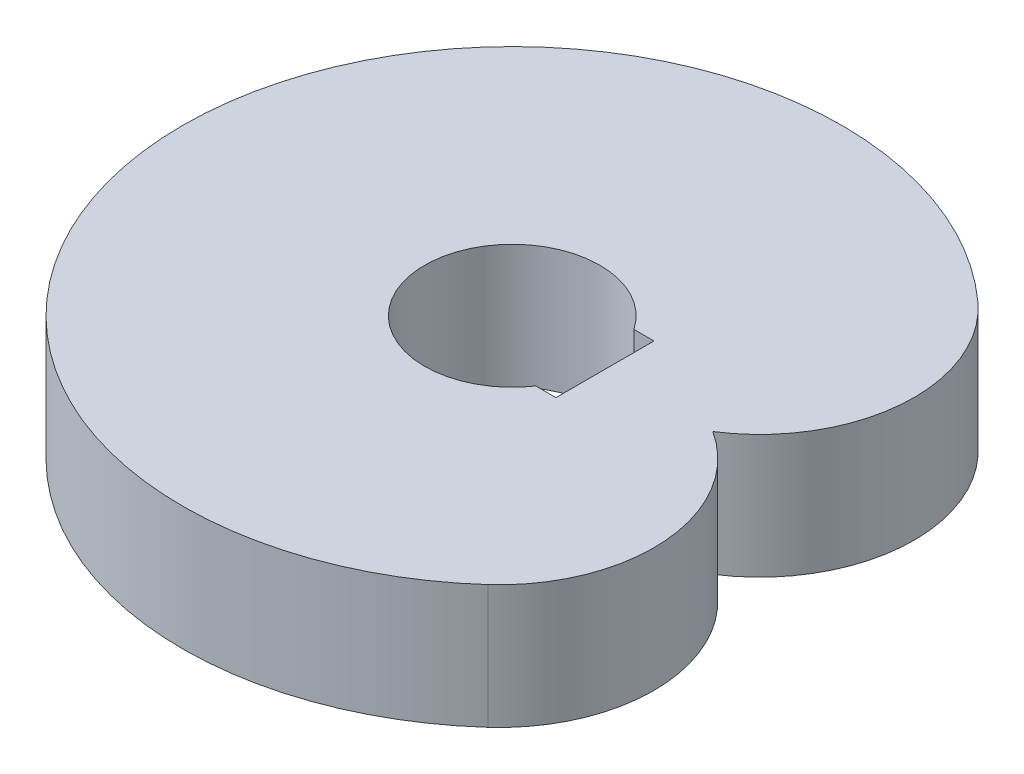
ISO-10303-21;
HEADER;
FILE_DESCRIPTION(('STEP AP214'),'2;1');
FILE_NAME('part.step','',(''),(''),'','','');
FILE_SCHEMA(('AUTOMOTIVE_DESIGN { 1 0 10303 214 1 1 1 1 }'));
ENDSEC;
DATA;
#1=APPLICATION_CONTEXT('core data for automotive mechanical design processes');
#2=APPLICATION_PROTOCOL_DEFINITION('international standard','automotive_design',2000,#1);
#3=PRODUCT_CONTEXT('',#1,'mechanical');
#4=PRODUCT('Part','Part','',(#3));
#5=PRODUCT_RELATED_PRODUCT_CATEGORY('part','',(#4));
#6=PRODUCT_DEFINITION_FORMATION('','',#4);
#7=PRODUCT_DEFINITION_CONTEXT('part definition',#1,'design');
#8=PRODUCT_DEFINITION('design','',#6,#7);
#9=PRODUCT_DEFINITION_SHAPE('','',#8);
#10=(LENGTH_UNIT() NAMED_UNIT(*) SI_UNIT(.MILLI.,.METRE.));
#11=(NAMED_UNIT(*) PLANE_ANGLE_UNIT() SI_UNIT($,.RADIAN.));
#12=(NAMED_UNIT(*) SI_UNIT($,.STERADIAN.) SOLID_ANGLE_UNIT());
#13=UNCERTAINTY_MEASURE_WITH_UNIT(LENGTH_MEASURE(1.E-05),#10,'distance_accuracy_value','');
#14=(GEOMETRIC_REPRESENTATION_CONTEXT(3) GLOBAL_UNCERTAINTY_ASSIGNED_CONTEXT((#13)) GLOBAL_UNIT_ASSIGNED_CONTEXT((#10,
#11,#12)) REPRESENTATION_CONTEXT('',''));
#15=CARTESIAN_POINT('',(0.,0.,0.));
#16=DIRECTION('',(0.,0.,1.));
#17=DIRECTION('',(1.,0.,0.));
#18=AXIS2_PLACEMENT_3D('',#15,#16,#17);
#19=CARTESIAN_POINT('',(19.1770418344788,0.,119.));
#20=DIRECTION('',(0.,0.,1.));
#21=DIRECTION('',(1.,0.,0.));
#22=AXIS2_PLACEMENT_3D('',#19,#20,#21);
#23=PLANE('',#22);
#24=DIRECTION('',(0.,1.,0.));
#25=VECTOR('',#24,1.);
#26=CARTESIAN_POINT('',(176.17536717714,300.,119.));
#27=LINE('',#26,#25);
#28=CARTESIAN_POINT('',(176.17536717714,0.,119.));
#29=VERTEX_POINT('',#28);
#30=CARTESIAN_POINT('',(176.17536717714,300.,119.));
#31=VERTEX_POINT('',#30);
#32=EDGE_CURVE('E147',#29,#31,#27,.T.);
#33=ORIENTED_EDGE('',*,*,#32,.T.);
#34=DIRECTION('',(1.,0.,0.));
#35=VECTOR('',#34,1.);
#36=CARTESIAN_POINT('',(19.1770418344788,300.,119.));
#37=LINE('',#36,#35);
#38=CARTESIAN_POINT('',(225.,300.,119.));
#39=VERTEX_POINT('',#38);
#40=EDGE_CURVE('E134',#31,#39,#37,.T.);
#41=ORIENTED_EDGE('',*,*,#40,.T.);
#42=DIRECTION('',(0.,1.,0.));
#43=VECTOR('',#42,1.);
#44=CARTESIAN_POINT('',(225.,0.,119.));
#45=LINE('',#44,#43);
#46=CARTESIAN_POINT('',(225.,0.,119.));
#47=VERTEX_POINT('',#46);
#48=EDGE_CURVE('E11',#47,#39,#45,.T.);
#49=ORIENTED_EDGE('',*,*,#48,.F.);
#50=DIRECTION('',(1.,0.,0.));
#51=VECTOR('',#50,1.);
#52=CARTESIAN_POINT('',(0.,0.,119.));
#53=LINE('',#52,#51);
#54=EDGE_CURVE('E173',#29,#47,#53,.T.);
#55=ORIENTED_EDGE('',*,*,#54,.F.);
#56=EDGE_LOOP('',(#33,#41,#49,#55));
#57=FACE_BOUND('',#56,.T.);
#58=ADVANCED_FACE('F16',(#57),#23,.F.);
#59=CARTESIAN_POINT('',(225.,0.,-119.));
#60=DIRECTION('',(1.,0.,0.));
#61=DIRECTION('',(0.,1.,0.));
#62=AXIS2_PLACEMENT_3D('',#59,#60,#61);
#63=PLANE('',#62);
#64=DIRECTION('',(0.,0.,-1.));
#65=VECTOR('',#64,1.);
#66=CARTESIAN_POINT('',(225.,300.,-119.));
#67=LINE('',#66,#65);
#68=CARTESIAN_POINT('',(225.,300.,-119.));
#69=VERTEX_POINT('',#68);
#70=EDGE_CURVE('E167',#39,#69,#67,.T.);
#71=ORIENTED_EDGE('',*,*,#70,.T.);
#72=DIRECTION('',(0.,1.,0.));
#73=VECTOR('',#72,1.);
#74=CARTESIAN_POINT('',(225.,0.,-119.));
#75=LINE('',#74,#73);
#76=CARTESIAN_POINT('',(225.,0.,-119.));
#77=VERTEX_POINT('',#76);
#78=EDGE_CURVE('E27',#77,#69,#75,.T.);
#79=ORIENTED_EDGE('',*,*,#78,.F.);
#80=DIRECTION('',(0.,0.,-1.));
#81=VECTOR('',#80,1.);
#82=CARTESIAN_POINT('',(225.,0.,-119.));
#83=LINE('',#82,#81);
#84=EDGE_CURVE('E130',#47,#77,#83,.T.);
#85=ORIENTED_EDGE('',*,*,#84,.F.);
#86=ORIENTED_EDGE('',*,*,#48,.T.);
#87=EDGE_LOOP('',(#71,#79,#85,#86));
#88=FACE_BOUND('',#87,.T.);
#89=ADVANCED_FACE('F18',(#88),#63,.F.);
#90=CARTESIAN_POINT('',(19.1770418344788,0.,-119.));
#91=DIRECTION('',(0.,0.,-1.));
#92=DIRECTION('',(0.,-1.,0.));
#93=AXIS2_PLACEMENT_3D('',#90,#91,#92);
#94=PLANE('',#93);
#95=DIRECTION('',(0.,-1.,0.));
#96=VECTOR('',#95,1.);
#97=CARTESIAN_POINT('',(176.17536717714,300.,-119.));
#98=LINE('',#97,#96);
#99=CARTESIAN_POINT('',(176.17536717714,300.,-119.));
#100=VERTEX_POINT('',#99);
#101=CARTESIAN_POINT('',(176.17536717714,0.,-119.));
#102=VERTEX_POINT('',#101);
#103=EDGE_CURVE('E140',#100,#102,#98,.T.);
#104=ORIENTED_EDGE('',*,*,#103,.T.);
#105=DIRECTION('',(-1.,0.,0.));
#106=VECTOR('',#105,1.);
#107=CARTESIAN_POINT('',(19.1770418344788,0.,-119.));
#108=LINE('',#107,#106);
#109=EDGE_CURVE('E133',#77,#102,#108,.T.);
#110=ORIENTED_EDGE('',*,*,#109,.F.);
#111=ORIENTED_EDGE('',*,*,#78,.T.);
#112=DIRECTION('',(-1.,0.,0.));
#113=VECTOR('',#112,1.);
#114=CARTESIAN_POINT('',(19.1770418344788,300.,-119.));
#115=LINE('',#114,#113);
#116=EDGE_CURVE('E159',#69,#100,#115,.T.);
#117=ORIENTED_EDGE('',*,*,#116,.T.);
#118=EDGE_LOOP('',(#104,#110,#111,#117));
#119=FACE_BOUND('',#118,.T.);
#120=ADVANCED_FACE('F269',(#119),#94,.F.);
#121=CARTESIAN_POINT('',(0.,0.,0.));
#122=DIRECTION('',(0.,1.,0.));
#123=DIRECTION('',(1.,0.,0.));
#124=AXIS2_PLACEMENT_3D('',#121,#122,#123);
#125=PLANE('',#124);
#126=ORIENTED_EDGE('',*,*,#84,.T.);
#127=ORIENTED_EDGE('',*,*,#109,.T.);
#128=CARTESIAN_POINT('',(0.,0.,0.));
#129=DIRECTION('',(0.,1.,0.));
#130=DIRECTION('',(0.,0.,1.));
#131=AXIS2_PLACEMENT_3D('',#128,#129,#130);
#132=CIRCLE('',#131,212.6);
#133=EDGE_CURVE('E150',#102,#29,#132,.T.);
#134=ORIENTED_EDGE('',*,*,#133,.T.);
#135=ORIENTED_EDGE('',*,*,#54,.T.);
#136=EDGE_LOOP('',(#126,#127,#134,#135));
#137=FACE_BOUND('',#136,.T.);
#138=CARTESIAN_POINT('',(284.380507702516,0.,315.836550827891));
#139=DIRECTION('',(0.,1.,0.));
#140=DIRECTION('',(0.,0.,1.));
#141=AXIS2_PLACEMENT_3D('',#138,#139,#140);
#142=CIRCLE('',#141,375.);
#143=CARTESIAN_POINT('',(535.30448508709,0.,594.515860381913));
#144=VERTEX_POINT('',#143);
#145=CARTESIAN_POINT('',(486.549430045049,0.,0.));
#146=VERTEX_POINT('',#145);
#147=EDGE_CURVE('E104',#144,#146,#142,.T.);
#148=ORIENTED_EDGE('',*,*,#147,.F.);
#149=CARTESIAN_POINT('',(0.,0.,0.));
#150=DIRECTION('',(0.,1.,0.));
#151=DIRECTION('',(0.,0.,1.));
#152=AXIS2_PLACEMENT_3D('',#149,#150,#151);
#153=CIRCLE('',#152,800.);
#154=CARTESIAN_POINT('',(535.30448508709,0.,-594.515860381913));
#155=VERTEX_POINT('',#154);
#156=EDGE_CURVE('E98',#155,#144,#153,.T.);
#157=ORIENTED_EDGE('',*,*,#156,.F.);
#158=CARTESIAN_POINT('',(284.380507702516,0.,-315.836550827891));
#159=DIRECTION('',(0.,1.,0.));
#160=DIRECTION('',(0.,0.,1.));
#161=AXIS2_PLACEMENT_3D('',#158,#159,#160);
#162=CIRCLE('',#161,375.);
#163=EDGE_CURVE('E101',#146,#155,#162,.T.);
#164=ORIENTED_EDGE('',*,*,#163,.F.);
#165=EDGE_LOOP('',(#148,#157,#164));
#166=FACE_BOUND('',#165,.T.);
#167=ADVANCED_FACE('F99',(#137,#166),#125,.F.);
#168=CARTESIAN_POINT('',(0.,300.,0.));
#169=DIRECTION('',(0.,1.,0.));
#170=DIRECTION('',(1.,0.,0.));
#171=AXIS2_PLACEMENT_3D('',#168,#169,#170);
#172=PLANE('',#171);
#173=ORIENTED_EDGE('',*,*,#116,.F.);
#174=ORIENTED_EDGE('',*,*,#70,.F.);
#175=ORIENTED_EDGE('',*,*,#40,.F.);
#176=CARTESIAN_POINT('',(0.,300.,0.));
#177=DIRECTION('',(0.,1.,0.));
#178=DIRECTION('',(0.,0.,1.));
#179=AXIS2_PLACEMENT_3D('',#176,#177,#178);
#180=CIRCLE('',#179,212.6);
#181=EDGE_CURVE('E144',#100,#31,#180,.T.);
#182=ORIENTED_EDGE('',*,*,#181,.F.);
#183=EDGE_LOOP('',(#173,#174,#175,#182));
#184=FACE_BOUND('',#183,.T.);
#185=CARTESIAN_POINT('',(284.380507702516,300.,315.836550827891));
#186=DIRECTION('',(0.,1.,0.));
#187=DIRECTION('',(0.,0.,1.));
#188=AXIS2_PLACEMENT_3D('',#185,#186,#187);
#189=CIRCLE('',#188,375.);
#190=CARTESIAN_POINT('',(535.30448508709,300.,594.515860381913));
#191=VERTEX_POINT('',#190);
#192=CARTESIAN_POINT('',(486.549430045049,300.,0.));
#193=VERTEX_POINT('',#192);
#194=EDGE_CURVE('E126',#191,#193,#189,.T.);
#195=ORIENTED_EDGE('',*,*,#194,.T.);
#196=CARTESIAN_POINT('',(284.380507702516,300.,-315.836550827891));
#197=DIRECTION('',(0.,1.,0.));
#198=DIRECTION('',(0.,0.,1.));
#199=AXIS2_PLACEMENT_3D('',#196,#197,#198);
#200=CIRCLE('',#199,375.);
#201=CARTESIAN_POINT('',(535.30448508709,300.,-594.515860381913));
#202=VERTEX_POINT('',#201);
#203=EDGE_CURVE('E107',#193,#202,#200,.T.);
#204=ORIENTED_EDGE('',*,*,#203,.T.);
#205=CARTESIAN_POINT('',(0.,300.,0.));
#206=DIRECTION('',(0.,1.,0.));
#207=DIRECTION('',(0.,0.,1.));
#208=AXIS2_PLACEMENT_3D('',#205,#206,#207);
#209=CIRCLE('',#208,800.);
#210=EDGE_CURVE('E90',#202,#191,#209,.T.);
#211=ORIENTED_EDGE('',*,*,#210,.T.);
#212=EDGE_LOOP('',(#195,#204,#211));
#213=FACE_BOUND('',#212,.T.);
#214=ADVANCED_FACE('F190',(#184,#213),#172,.T.);
#215=CARTESIAN_POINT('',(0.,300.,0.));
#216=DIRECTION('',(0.,-1.,0.));
#217=DIRECTION('',(0.,0.,-1.));
#218=AXIS2_PLACEMENT_3D('',#215,#216,#217);
#219=CYLINDRICAL_SURFACE('',#218,212.6);
#220=ORIENTED_EDGE('',*,*,#103,.F.);
#221=ORIENTED_EDGE('',*,*,#181,.T.);
#222=ORIENTED_EDGE('',*,*,#32,.F.);
#223=ORIENTED_EDGE('',*,*,#133,.F.);
#224=EDGE_LOOP('',(#220,#221,#222,#223));
#225=FACE_BOUND('',#224,.T.);
#226=ADVANCED_FACE('F279',(#225),#219,.F.);
#227=CARTESIAN_POINT('',(0.,300.,0.));
#228=DIRECTION('',(0.,-1.,0.));
#229=DIRECTION('',(0.,0.,-1.));
#230=AXIS2_PLACEMENT_3D('',#227,#228,#229);
#231=CYLINDRICAL_SURFACE('',#230,800.);
#232=ORIENTED_EDGE('',*,*,#156,.T.);
#233=DIRECTION('',(0.,-1.,0.));
#234=VECTOR('',#233,1.);
#235=CARTESIAN_POINT('',(535.30448508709,300.,594.515860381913));
#236=LINE('',#235,#234);
#237=EDGE_CURVE('E119',#191,#144,#236,.T.);
#238=ORIENTED_EDGE('',*,*,#237,.F.);
#239=ORIENTED_EDGE('',*,*,#210,.F.);
#240=DIRECTION('',(0.,-1.,0.));
#241=VECTOR('',#240,1.);
#242=CARTESIAN_POINT('',(535.30448508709,300.,-594.515860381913));
#243=LINE('',#242,#241);
#244=EDGE_CURVE('E110',#202,#155,#243,.T.);
#245=ORIENTED_EDGE('',*,*,#244,.T.);
#246=EDGE_LOOP('',(#232,#238,#239,#245));
#247=FACE_BOUND('',#246,.T.);
#248=ADVANCED_FACE('F111',(#247),#231,.T.);
#249=CARTESIAN_POINT('',(284.380507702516,300.,-315.836550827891));
#250=DIRECTION('',(0.,-1.,0.));
#251=DIRECTION('',(0.,0.,-1.));
#252=AXIS2_PLACEMENT_3D('',#249,#250,#251);
#253=CYLINDRICAL_SURFACE('',#252,375.);
#254=ORIENTED_EDGE('',*,*,#163,.T.);
#255=ORIENTED_EDGE('',*,*,#244,.F.);
#256=ORIENTED_EDGE('',*,*,#203,.F.);
#257=DIRECTION('',(0.,-1.,0.));
#258=VECTOR('',#257,1.);
#259=CARTESIAN_POINT('',(486.549430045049,300.,0.));
#260=LINE('',#259,#258);
#261=EDGE_CURVE('E20',#193,#146,#260,.T.);
#262=ORIENTED_EDGE('',*,*,#261,.T.);
#263=EDGE_LOOP('',(#254,#255,#256,#262));
#264=FACE_BOUND('',#263,.T.);
#265=ADVANCED_FACE('F116',(#264),#253,.T.);
#266=CARTESIAN_POINT('',(284.380507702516,300.,315.836550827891));
#267=DIRECTION('',(0.,-1.,0.));
#268=DIRECTION('',(0.,0.,-1.));
#269=AXIS2_PLACEMENT_3D('',#266,#267,#268);
#270=CYLINDRICAL_SURFACE('',#269,375.);
#271=ORIENTED_EDGE('',*,*,#147,.T.);
#272=ORIENTED_EDGE('',*,*,#261,.F.);
#273=ORIENTED_EDGE('',*,*,#194,.F.);
#274=ORIENTED_EDGE('',*,*,#237,.T.);
#275=EDGE_LOOP('',(#271,#272,#273,#274));
#276=FACE_BOUND('',#275,.T.);
#277=ADVANCED_FACE('F298',(#276),#270,.T.);
#278=CLOSED_SHELL('',(#58,#89,#120,#167,#214,#226,#248,#265,#277));
#279=MANIFOLD_SOLID_BREP('B1',#278);
#280=ADVANCED_BREP_SHAPE_REPRESENTATION('',(#18,#279),#14);
#281=SHAPE_DEFINITION_REPRESENTATION(#9,#280);
ENDSEC;
END-ISO-10303-21;
